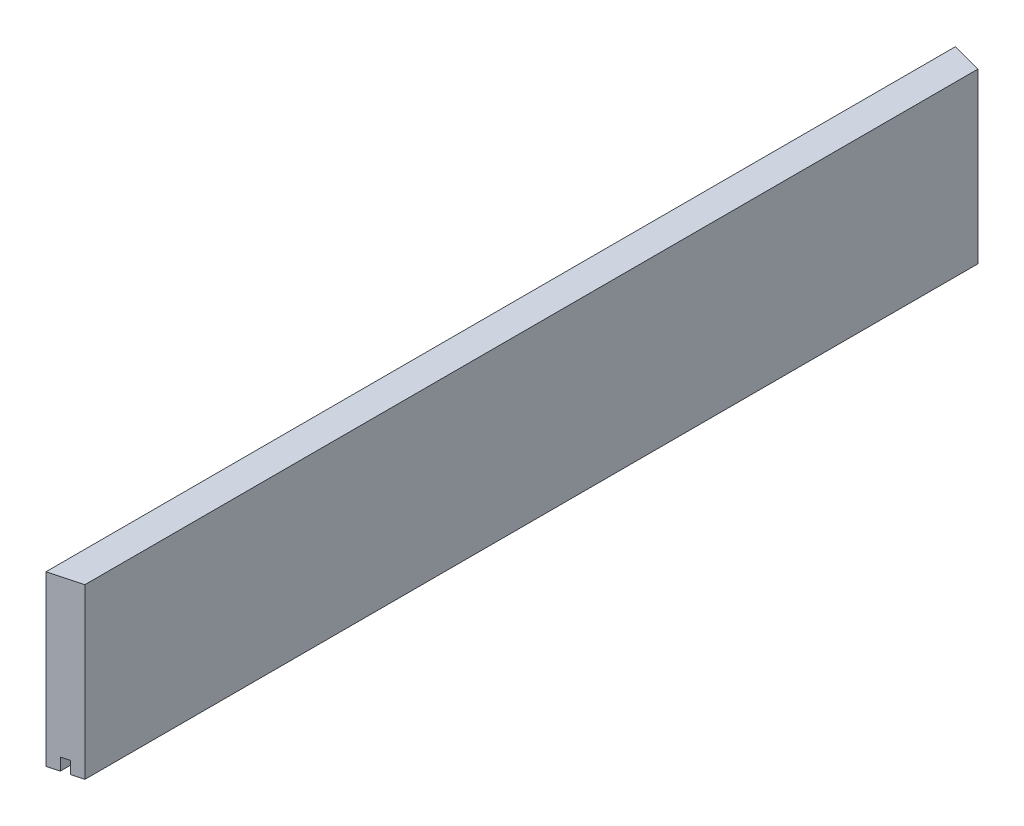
from build123d import *

# Parameters (mm, degrees)
BOSS_EXTRU_1_DEPTH           = 445
ENL_V_MAT_EXTRU_1_DEPTH      = 447.970706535
ENL_V_MAT_EXTRU_1_DEPTH_BACK = 447.970706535


with BuildPart() as part:
    # Esquisse1 → Boss.-Extru.1 (new body)
    with BuildSketch(Plane.XY):
        Polygon((7.5, 41.25), (-7.5, 41.25), (-7.5, -41.25), (-2, -41.25), (-2, -35.25), (2, -35.25), (2, -41.25), (7.5, -41.25), align=None)
    extrude(amount=BOSS_EXTRU_1_DEPTH)

    # Esquisse2 → Enl_v. mat.-Extru.1 (cut, two sides: drawn at the far end of the back side and taken through both)
    with BuildSketch(Plane(origin=(0, 0, 0), x_dir=(1, 0, 0), z_dir=(0, 1, 0)).offset(-ENL_V_MAT_EXTRU_1_DEPTH_BACK)):
        Polygon((-7.5, 0), (7.5, 0), (7.5, -4.019237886), align=None)
        Polygon((-7.5, -445), (7.5, -445), (7.5, -440.980762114), align=None)
    extrude(amount=ENL_V_MAT_EXTRU_1_DEPTH + ENL_V_MAT_EXTRU_1_DEPTH_BACK, mode=Mode.SUBTRACT)


solid = part.part
